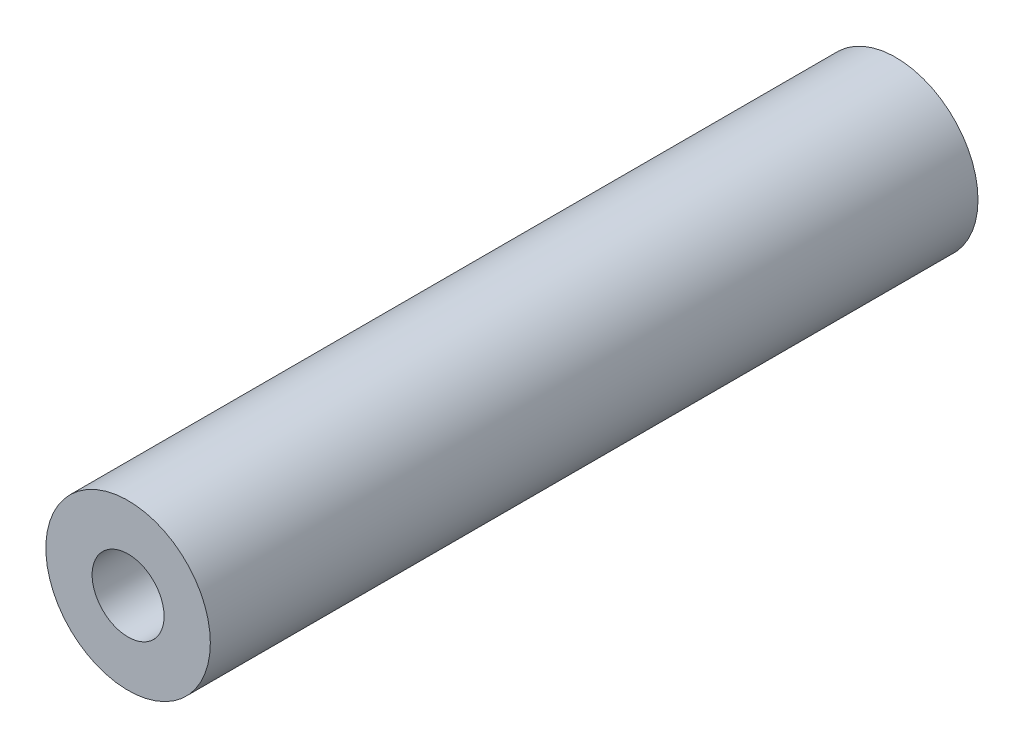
ISO-10303-21;
HEADER;
FILE_DESCRIPTION(('STEP AP214'),'2;1');
FILE_NAME('part.step','',(''),(''),'','','');
FILE_SCHEMA(('AUTOMOTIVE_DESIGN { 1 0 10303 214 1 1 1 1 }'));
ENDSEC;
DATA;
#1=APPLICATION_CONTEXT('core data for automotive mechanical design processes');
#2=APPLICATION_PROTOCOL_DEFINITION('international standard','automotive_design',2000,#1);
#3=PRODUCT_CONTEXT('',#1,'mechanical');
#4=PRODUCT('Part','Part','',(#3));
#5=PRODUCT_RELATED_PRODUCT_CATEGORY('part','',(#4));
#6=PRODUCT_DEFINITION_FORMATION('','',#4);
#7=PRODUCT_DEFINITION_CONTEXT('part definition',#1,'design');
#8=PRODUCT_DEFINITION('design','',#6,#7);
#9=PRODUCT_DEFINITION_SHAPE('','',#8);
#10=(LENGTH_UNIT() NAMED_UNIT(*) SI_UNIT(.MILLI.,.METRE.));
#11=(NAMED_UNIT(*) PLANE_ANGLE_UNIT() SI_UNIT($,.RADIAN.));
#12=(NAMED_UNIT(*) SI_UNIT($,.STERADIAN.) SOLID_ANGLE_UNIT());
#13=UNCERTAINTY_MEASURE_WITH_UNIT(LENGTH_MEASURE(1.E-05),#10,'distance_accuracy_value','');
#14=(GEOMETRIC_REPRESENTATION_CONTEXT(3) GLOBAL_UNCERTAINTY_ASSIGNED_CONTEXT((#13)) GLOBAL_UNIT_ASSIGNED_CONTEXT((#10,
#11,#12)) REPRESENTATION_CONTEXT('',''));
#15=CARTESIAN_POINT('',(0.,0.,0.));
#16=DIRECTION('',(0.,0.,1.));
#17=DIRECTION('',(1.,0.,0.));
#18=AXIS2_PLACEMENT_3D('',#15,#16,#17);
#19=CARTESIAN_POINT('',(0.,0.,22.225));
#20=DIRECTION('',(0.,0.,1.));
#21=DIRECTION('',(1.,0.,0.));
#22=AXIS2_PLACEMENT_3D('',#19,#20,#21);
#23=PLANE('',#22);
#24=CARTESIAN_POINT('',(0.,0.,22.225));
#25=DIRECTION('',(0.,0.,1.));
#26=DIRECTION('',(1.,0.,0.));
#27=AXIS2_PLACEMENT_3D('',#24,#25,#26);
#28=CIRCLE('',#27,2.0828);
#29=CARTESIAN_POINT('',(2.0828,0.,22.225));
#30=VERTEX_POINT('',#29);
#31=EDGE_CURVE('E64',#30,#30,#28,.T.);
#32=ORIENTED_EDGE('',*,*,#31,.F.);
#33=EDGE_LOOP('',(#32));
#34=FACE_BOUND('',#33,.T.);
#35=CARTESIAN_POINT('',(0.,0.,22.225));
#36=DIRECTION('',(0.,0.,1.));
#37=DIRECTION('',(1.,0.,0.));
#38=AXIS2_PLACEMENT_3D('',#35,#36,#37);
#39=CIRCLE('',#38,4.7625);
#40=CARTESIAN_POINT('',(4.7625,0.,22.225));
#41=VERTEX_POINT('',#40);
#42=EDGE_CURVE('E10',#41,#41,#39,.T.);
#43=ORIENTED_EDGE('',*,*,#42,.T.);
#44=EDGE_LOOP('',(#43));
#45=FACE_BOUND('',#44,.T.);
#46=ADVANCED_FACE('F37',(#34,#45),#23,.T.);
#47=CARTESIAN_POINT('',(0.,0.,-22.225));
#48=DIRECTION('',(0.,0.,1.));
#49=DIRECTION('',(1.,0.,0.));
#50=AXIS2_PLACEMENT_3D('',#47,#48,#49);
#51=PLANE('',#50);
#52=CARTESIAN_POINT('',(0.,0.,-22.225));
#53=DIRECTION('',(0.,0.,-1.));
#54=DIRECTION('',(-1.,0.,0.));
#55=AXIS2_PLACEMENT_3D('',#52,#53,#54);
#56=CIRCLE('',#55,2.0828);
#57=CARTESIAN_POINT('',(-2.0828,0.,-22.225));
#58=VERTEX_POINT('',#57);
#59=EDGE_CURVE('E77',#58,#58,#56,.T.);
#60=ORIENTED_EDGE('',*,*,#59,.F.);
#61=EDGE_LOOP('',(#60));
#62=FACE_BOUND('',#61,.T.);
#63=CARTESIAN_POINT('',(0.,0.,-22.225));
#64=DIRECTION('',(0.,0.,1.));
#65=DIRECTION('',(1.,0.,0.));
#66=AXIS2_PLACEMENT_3D('',#63,#64,#65);
#67=CIRCLE('',#66,4.7625);
#68=CARTESIAN_POINT('',(4.7625,0.,-22.225));
#69=VERTEX_POINT('',#68);
#70=EDGE_CURVE('E46',#69,#69,#67,.T.);
#71=ORIENTED_EDGE('',*,*,#70,.F.);
#72=EDGE_LOOP('',(#71));
#73=FACE_BOUND('',#72,.T.);
#74=ADVANCED_FACE('F84',(#62,#73),#51,.F.);
#75=CARTESIAN_POINT('',(0.,0.,22.225));
#76=DIRECTION('',(0.,0.,-1.));
#77=DIRECTION('',(-1.,0.,0.));
#78=AXIS2_PLACEMENT_3D('',#75,#76,#77);
#79=CYLINDRICAL_SURFACE('',#78,4.7625);
#80=ORIENTED_EDGE('',*,*,#42,.F.);
#81=EDGE_LOOP('',(#80));
#82=FACE_BOUND('',#81,.T.);
#83=ORIENTED_EDGE('',*,*,#70,.T.);
#84=EDGE_LOOP('',(#83));
#85=FACE_BOUND('',#84,.T.);
#86=ADVANCED_FACE('F39',(#82,#85),#79,.T.);
#87=CARTESIAN_POINT('',(0.,0.,22.225));
#88=DIRECTION('',(0.,0.,-1.));
#89=DIRECTION('',(-1.,0.,0.));
#90=AXIS2_PLACEMENT_3D('',#87,#88,#89);
#91=CYLINDRICAL_SURFACE('',#90,1.778);
#92=CARTESIAN_POINT('',(0.,0.,-9.525));
#93=DIRECTION('',(0.,0.,1.));
#94=DIRECTION('',(1.,0.,0.));
#95=AXIS2_PLACEMENT_3D('',#92,#93,#94);
#96=CIRCLE('',#95,1.778);
#97=CARTESIAN_POINT('',(1.778,0.,-9.525));
#98=VERTEX_POINT('',#97);
#99=EDGE_CURVE('E41',#98,#98,#96,.T.);
#100=ORIENTED_EDGE('',*,*,#99,.F.);
#101=EDGE_LOOP('',(#100));
#102=FACE_BOUND('',#101,.T.);
#103=CARTESIAN_POINT('',(0.,0.,9.525));
#104=DIRECTION('',(0.,0.,-1.));
#105=DIRECTION('',(-1.,0.,0.));
#106=AXIS2_PLACEMENT_3D('',#103,#104,#105);
#107=CIRCLE('',#106,1.778);
#108=CARTESIAN_POINT('',(-1.778,0.,9.525));
#109=VERTEX_POINT('',#108);
#110=EDGE_CURVE('E53',#109,#109,#107,.T.);
#111=ORIENTED_EDGE('',*,*,#110,.F.);
#112=EDGE_LOOP('',(#111));
#113=FACE_BOUND('',#112,.T.);
#114=ADVANCED_FACE('F90',(#102,#113),#91,.F.);
#115=CARTESIAN_POINT('',(1.7272,0.,9.525));
#116=DIRECTION('',(0.,0.,-1.));
#117=DIRECTION('',(-1.,0.,0.));
#118=AXIS2_PLACEMENT_3D('',#115,#116,#117);
#119=PLANE('',#118);
#120=ORIENTED_EDGE('',*,*,#110,.T.);
#121=EDGE_LOOP('',(#120));
#122=FACE_BOUND('',#121,.T.);
#123=CARTESIAN_POINT('',(0.,0.,9.525));
#124=DIRECTION('',(0.,0.,1.));
#125=DIRECTION('',(1.,0.,0.));
#126=AXIS2_PLACEMENT_3D('',#123,#124,#125);
#127=CIRCLE('',#126,2.08279999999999);
#128=CARTESIAN_POINT('',(2.08279999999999,0.,9.525));
#129=VERTEX_POINT('',#128);
#130=EDGE_CURVE('E56',#129,#129,#127,.T.);
#131=ORIENTED_EDGE('',*,*,#130,.T.);
#132=EDGE_LOOP('',(#131));
#133=FACE_BOUND('',#132,.T.);
#134=ADVANCED_FACE('F95',(#122,#133),#119,.F.);
#135=CARTESIAN_POINT('',(0.,0.,22.225));
#136=DIRECTION('',(0.,0.,1.));
#137=DIRECTION('',(1.,0.,0.));
#138=AXIS2_PLACEMENT_3D('',#135,#136,#137);
#139=CYLINDRICAL_SURFACE('',#138,2.08279999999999);
#140=ORIENTED_EDGE('',*,*,#130,.F.);
#141=EDGE_LOOP('',(#140));
#142=FACE_BOUND('',#141,.T.);
#143=ORIENTED_EDGE('',*,*,#31,.T.);
#144=EDGE_LOOP('',(#143));
#145=FACE_BOUND('',#144,.T.);
#146=ADVANCED_FACE('F106',(#142,#145),#139,.F.);
#147=CARTESIAN_POINT('',(1.72719999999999,0.,-9.525));
#148=DIRECTION('',(0.,0.,1.));
#149=DIRECTION('',(1.,0.,0.));
#150=AXIS2_PLACEMENT_3D('',#147,#148,#149);
#151=PLANE('',#150);
#152=ORIENTED_EDGE('',*,*,#99,.T.);
#153=EDGE_LOOP('',(#152));
#154=FACE_BOUND('',#153,.T.);
#155=CARTESIAN_POINT('',(0.,0.,-9.525));
#156=DIRECTION('',(0.,0.,-1.));
#157=DIRECTION('',(-1.,0.,0.));
#158=AXIS2_PLACEMENT_3D('',#155,#156,#157);
#159=CIRCLE('',#158,2.0828);
#160=CARTESIAN_POINT('',(-2.0828,0.,-9.525));
#161=VERTEX_POINT('',#160);
#162=EDGE_CURVE('E73',#161,#161,#159,.T.);
#163=ORIENTED_EDGE('',*,*,#162,.T.);
#164=EDGE_LOOP('',(#163));
#165=FACE_BOUND('',#164,.T.);
#166=ADVANCED_FACE('F109',(#154,#165),#151,.F.);
#167=CARTESIAN_POINT('',(0.,0.,-22.225));
#168=DIRECTION('',(0.,0.,-1.));
#169=DIRECTION('',(-1.,0.,0.));
#170=AXIS2_PLACEMENT_3D('',#167,#168,#169);
#171=CYLINDRICAL_SURFACE('',#170,2.0828);
#172=ORIENTED_EDGE('',*,*,#162,.F.);
#173=EDGE_LOOP('',(#172));
#174=FACE_BOUND('',#173,.T.);
#175=ORIENTED_EDGE('',*,*,#59,.T.);
#176=EDGE_LOOP('',(#175));
#177=FACE_BOUND('',#176,.T.);
#178=ADVANCED_FACE('F82',(#174,#177),#171,.F.);
#179=CLOSED_SHELL('',(#46,#74,#86,#114,#134,#146,#166,#178));
#180=MANIFOLD_SOLID_BREP('B2',#179);
#181=ADVANCED_BREP_SHAPE_REPRESENTATION('',(#18,#180),#14);
#182=SHAPE_DEFINITION_REPRESENTATION(#9,#181);
ENDSEC;
END-ISO-10303-21;
